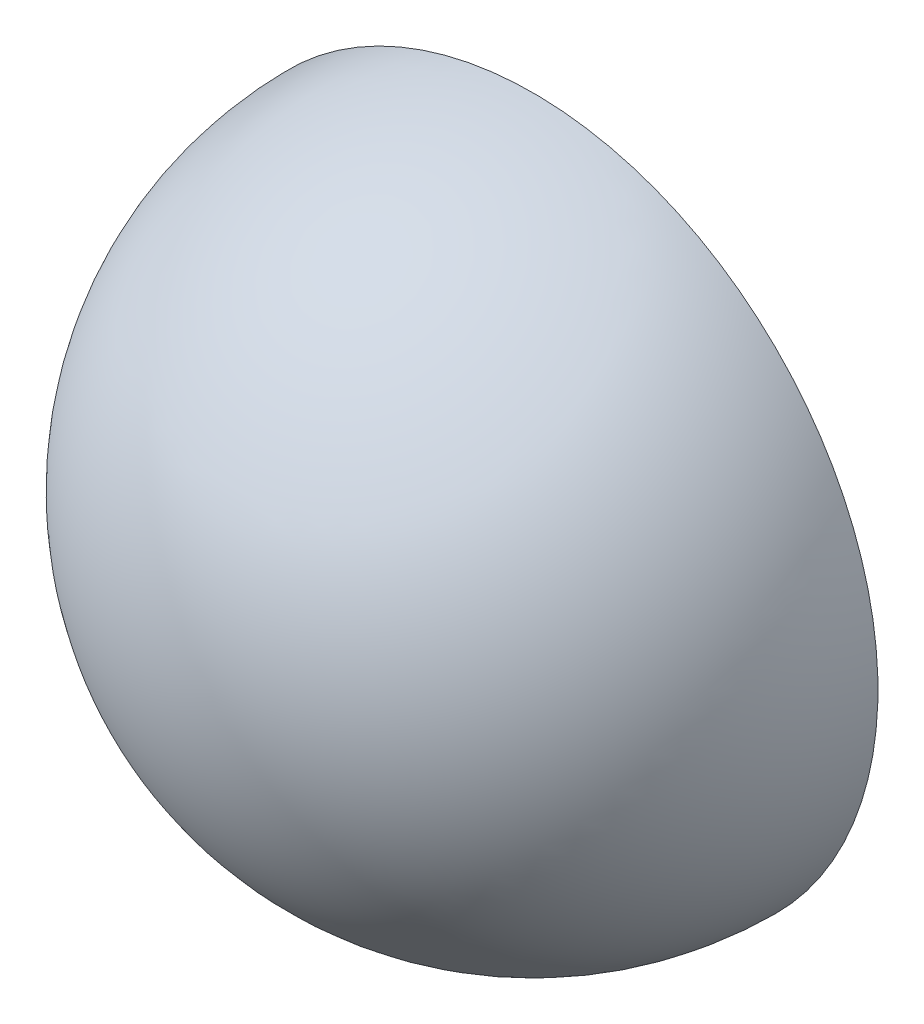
ISO-10303-21;
HEADER;
FILE_DESCRIPTION(('STEP AP214'),'2;1');
FILE_NAME('part.step','',(''),(''),'','','');
FILE_SCHEMA(('AUTOMOTIVE_DESIGN { 1 0 10303 214 1 1 1 1 }'));
ENDSEC;
DATA;
#1=APPLICATION_CONTEXT('core data for automotive mechanical design processes');
#2=APPLICATION_PROTOCOL_DEFINITION('international standard','automotive_design',2000,#1);
#3=PRODUCT_CONTEXT('',#1,'mechanical');
#4=PRODUCT('Part','Part','',(#3));
#5=PRODUCT_RELATED_PRODUCT_CATEGORY('part','',(#4));
#6=PRODUCT_DEFINITION_FORMATION('','',#4);
#7=PRODUCT_DEFINITION_CONTEXT('part definition',#1,'design');
#8=PRODUCT_DEFINITION('design','',#6,#7);
#9=PRODUCT_DEFINITION_SHAPE('','',#8);
#10=(LENGTH_UNIT() NAMED_UNIT(*) SI_UNIT(.MILLI.,.METRE.));
#11=(NAMED_UNIT(*) PLANE_ANGLE_UNIT() SI_UNIT($,.RADIAN.));
#12=(NAMED_UNIT(*) SI_UNIT($,.STERADIAN.) SOLID_ANGLE_UNIT());
#13=UNCERTAINTY_MEASURE_WITH_UNIT(LENGTH_MEASURE(1.E-05),#10,'distance_accuracy_value','');
#14=(GEOMETRIC_REPRESENTATION_CONTEXT(3) GLOBAL_UNCERTAINTY_ASSIGNED_CONTEXT((#13)) GLOBAL_UNIT_ASSIGNED_CONTEXT((#10,
#11,#12)) REPRESENTATION_CONTEXT('',''));
#15=CARTESIAN_POINT('',(0.,0.,0.));
#16=DIRECTION('',(0.,0.,1.));
#17=DIRECTION('',(1.,0.,0.));
#18=AXIS2_PLACEMENT_3D('',#15,#16,#17);
#19=CARTESIAN_POINT('',(0.,0.,0.));
#20=DIRECTION('',(0.,1.,0.));
#21=DIRECTION('',(-1.,0.,0.));
#22=AXIS2_PLACEMENT_3D('',#19,#20,#21);
#23=SPHERICAL_SURFACE('',#22,38.1);
#24=CARTESIAN_POINT('',(0.,0.,0.));
#25=DIRECTION('',(0.,0.,-1.));
#26=DIRECTION('',(-1.,0.,0.));
#27=AXIS2_PLACEMENT_3D('',#24,#25,#26);
#28=SPHERICAL_SURFACE('',#27,38.1);
#29=CARTESIAN_POINT('',(0.,0.,0.));
#30=DIRECTION('',(0.,0.,-1.));
#31=DIRECTION('',(-1.,0.,0.));
#32=AXIS2_PLACEMENT_3D('',#29,#30,#31);
#33=CIRCLE('',#32,38.1);
#34=CARTESIAN_POINT('',(-38.1,0.,-2.66050878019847E-13));
#35=VERTEX_POINT('',#34);
#36=EDGE_CURVE('E46',#35,#35,#33,.T.);
#37=ORIENTED_EDGE('',*,*,#36,.F.);
#38=EDGE_LOOP('',(#37));
#39=FACE_BOUND('',#38,.T.);
#40=ADVANCED_FACE('F39',(#39),#28,.T.);
#41=CARTESIAN_POINT('',(0.,0.,0.));
#42=DIRECTION('',(0.,1.,0.));
#43=DIRECTION('',(1.,0.,0.));
#44=AXIS2_PLACEMENT_3D('',#41,#42,#43);
#45=SPHERICAL_SURFACE('',#44,34.3581670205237);
#46=CARTESIAN_POINT('',(0.,0.,0.));
#47=DIRECTION('',(0.,0.,1.));
#48=DIRECTION('',(-1.,0.,0.));
#49=AXIS2_PLACEMENT_3D('',#46,#47,#48);
#50=SPHERICAL_SURFACE('',#49,34.3581670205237);
#51=CARTESIAN_POINT('',(0.,0.,0.));
#52=DIRECTION('',(0.,0.,1.));
#53=DIRECTION('',(-1.,0.,0.));
#54=AXIS2_PLACEMENT_3D('',#51,#52,#53);
#55=CIRCLE('',#54,34.3581670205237);
#56=CARTESIAN_POINT('',(-34.3581670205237,0.,-2.39921797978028E-13));
#57=VERTEX_POINT('',#56);
#58=EDGE_CURVE('E10',#57,#57,#55,.T.);
#59=ORIENTED_EDGE('',*,*,#58,.F.);
#60=EDGE_LOOP('',(#59));
#61=FACE_BOUND('',#60,.T.);
#62=ADVANCED_FACE('F41',(#61),#50,.F.);
#63=CARTESIAN_POINT('',(0.,0.,0.));
#64=DIRECTION('',(0.,0.,-1.));
#65=DIRECTION('',(-1.,0.,0.));
#66=AXIS2_PLACEMENT_3D('',#63,#64,#65);
#67=PLANE('',#66);
#68=ORIENTED_EDGE('',*,*,#58,.T.);
#69=EDGE_LOOP('',(#68));
#70=FACE_BOUND('',#69,.T.);
#71=ORIENTED_EDGE('',*,*,#36,.T.);
#72=EDGE_LOOP('',(#71));
#73=FACE_BOUND('',#72,.T.);
#74=ADVANCED_FACE('F52',(#70,#73),#67,.T.);
#75=CLOSED_SHELL('',(#40,#62,#74));
#76=MANIFOLD_SOLID_BREP('B2',#75);
#77=ADVANCED_BREP_SHAPE_REPRESENTATION('',(#18,#76),#14);
#78=SHAPE_DEFINITION_REPRESENTATION(#9,#77);
ENDSEC;
END-ISO-10303-21;
